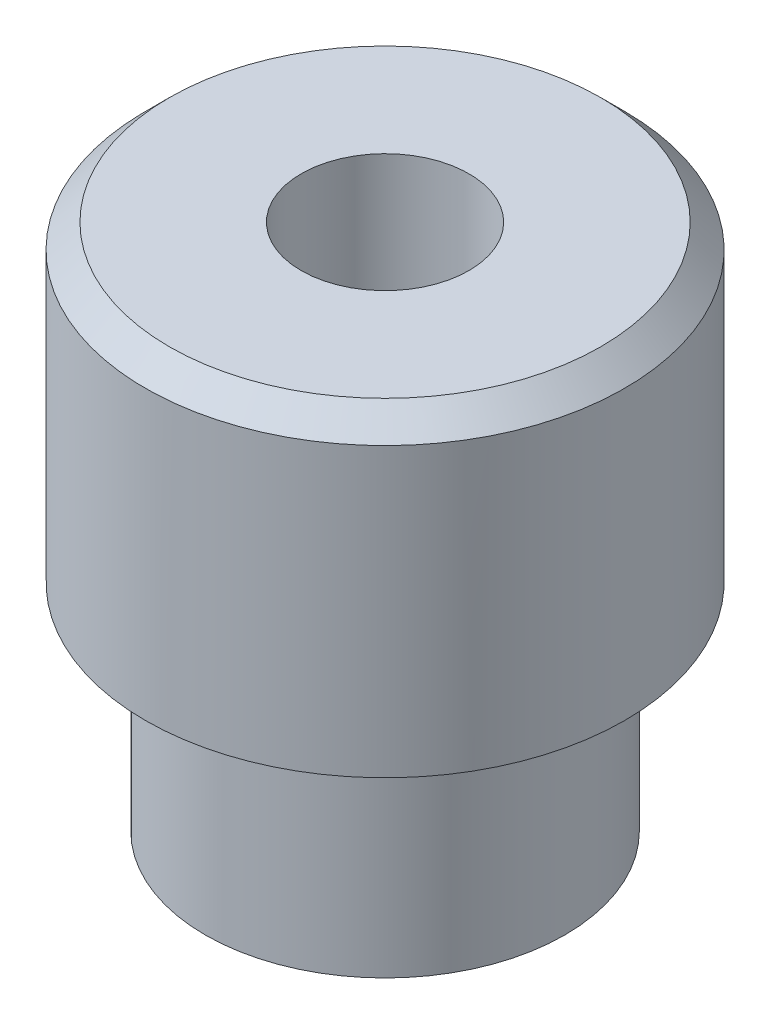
ISO-10303-21;
HEADER;
FILE_DESCRIPTION(('STEP AP214'),'2;1');
FILE_NAME('part.step','',(''),(''),'','','');
FILE_SCHEMA(('AUTOMOTIVE_DESIGN { 1 0 10303 214 1 1 1 1 }'));
ENDSEC;
DATA;
#1=APPLICATION_CONTEXT('core data for automotive mechanical design processes');
#2=APPLICATION_PROTOCOL_DEFINITION('international standard','automotive_design',2000,#1);
#3=PRODUCT_CONTEXT('',#1,'mechanical');
#4=PRODUCT('Part','Part','',(#3));
#5=PRODUCT_RELATED_PRODUCT_CATEGORY('part','',(#4));
#6=PRODUCT_DEFINITION_FORMATION('','',#4);
#7=PRODUCT_DEFINITION_CONTEXT('part definition',#1,'design');
#8=PRODUCT_DEFINITION('design','',#6,#7);
#9=PRODUCT_DEFINITION_SHAPE('','',#8);
#10=(LENGTH_UNIT() NAMED_UNIT(*) SI_UNIT(.MILLI.,.METRE.));
#11=(NAMED_UNIT(*) PLANE_ANGLE_UNIT() SI_UNIT($,.RADIAN.));
#12=(NAMED_UNIT(*) SI_UNIT($,.STERADIAN.) SOLID_ANGLE_UNIT());
#13=UNCERTAINTY_MEASURE_WITH_UNIT(LENGTH_MEASURE(1.E-05),#10,'distance_accuracy_value','');
#14=(GEOMETRIC_REPRESENTATION_CONTEXT(3) GLOBAL_UNCERTAINTY_ASSIGNED_CONTEXT((#13)) GLOBAL_UNIT_ASSIGNED_CONTEXT((#10,
#11,#12)) REPRESENTATION_CONTEXT('',''));
#15=CARTESIAN_POINT('',(0.,0.,0.));
#16=DIRECTION('',(0.,0.,1.));
#17=DIRECTION('',(1.,0.,0.));
#18=AXIS2_PLACEMENT_3D('',#15,#16,#17);
#19=CARTESIAN_POINT('',(0.,9.,0.));
#20=DIRECTION('',(0.,-1.,0.));
#21=DIRECTION('',(0.,0.,-1.));
#22=AXIS2_PLACEMENT_3D('',#19,#20,#21);
#23=CYLINDRICAL_SURFACE('',#22,7.5);
#24=CARTESIAN_POINT('',(0.,7.50000000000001,0.));
#25=DIRECTION('',(0.,1.,0.));
#26=DIRECTION('',(0.,0.,1.));
#27=AXIS2_PLACEMENT_3D('',#24,#25,#26);
#28=CIRCLE('',#27,7.5);
#29=CARTESIAN_POINT('',(0.,7.50000000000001,7.5));
#30=VERTEX_POINT('',#29);
#31=EDGE_CURVE('E44',#30,#30,#28,.F.);
#32=ORIENTED_EDGE('',*,*,#31,.T.);
#33=EDGE_LOOP('',(#32));
#34=FACE_BOUND('',#33,.T.);
#35=CARTESIAN_POINT('',(0.,0.,0.));
#36=DIRECTION('',(0.,1.,0.));
#37=DIRECTION('',(0.,0.,1.));
#38=AXIS2_PLACEMENT_3D('',#35,#36,#37);
#39=CIRCLE('',#38,7.5);
#40=CARTESIAN_POINT('',(0.,0.,7.5));
#41=VERTEX_POINT('',#40);
#42=EDGE_CURVE('E48',#41,#41,#39,.T.);
#43=ORIENTED_EDGE('',*,*,#42,.T.);
#44=EDGE_LOOP('',(#43));
#45=FACE_BOUND('',#44,.T.);
#46=ADVANCED_FACE('F33',(#34,#45),#23,.T.);
#47=CARTESIAN_POINT('',(0.,0.,0.));
#48=DIRECTION('',(0.,1.,0.));
#49=DIRECTION('',(0.,0.,1.));
#50=AXIS2_PLACEMENT_3D('',#47,#48,#49);
#51=PLANE('',#50);
#52=CARTESIAN_POINT('',(0.,0.,0.));
#53=DIRECTION('',(0.,1.,0.));
#54=DIRECTION('',(0.,0.,1.));
#55=AXIS2_PLACEMENT_3D('',#52,#53,#54);
#56=CIRCLE('',#55,3.5);
#57=CARTESIAN_POINT('',(0.,0.,3.5));
#58=VERTEX_POINT('',#57);
#59=EDGE_CURVE('E56',#58,#58,#56,.T.);
#60=ORIENTED_EDGE('',*,*,#59,.T.);
#61=EDGE_LOOP('',(#60));
#62=FACE_BOUND('',#61,.T.);
#63=ORIENTED_EDGE('',*,*,#42,.F.);
#64=EDGE_LOOP('',(#63));
#65=FACE_BOUND('',#64,.T.);
#66=ADVANCED_FACE('F63',(#62,#65),#51,.F.);
#67=CARTESIAN_POINT('',(0.,22.,0.));
#68=DIRECTION('',(0.,-1.,0.));
#69=DIRECTION('',(0.,0.,-1.));
#70=AXIS2_PLACEMENT_3D('',#67,#68,#69);
#71=CYLINDRICAL_SURFACE('',#70,10.);
#72=CARTESIAN_POINT('',(0.,21.,0.));
#73=DIRECTION('',(0.,1.,0.));
#74=DIRECTION('',(0.,0.,1.));
#75=AXIS2_PLACEMENT_3D('',#72,#73,#74);
#76=CIRCLE('',#75,10.);
#77=CARTESIAN_POINT('',(0.,21.,-10.));
#78=VERTEX_POINT('',#77);
#79=EDGE_CURVE('E10',#78,#78,#76,.F.);
#80=CARTESIAN_POINT('',(0.,9.,0.));
#81=DIRECTION('',(0.,1.,0.));
#82=DIRECTION('',(0.,0.,1.));
#83=AXIS2_PLACEMENT_3D('',#80,#81,#82);
#84=CIRCLE('',#83,10.);
#85=CARTESIAN_POINT('',(0.,9.,-10.));
#86=VERTEX_POINT('',#85);
#87=EDGE_CURVE('E53',#86,#86,#84,.T.);
#88=CARTESIAN_POINT('',(0.,21.,-10.));
#89=CARTESIAN_POINT('',(0.,20.875,-10.));
#90=CARTESIAN_POINT('',(0.,20.75,-10.));
#91=CARTESIAN_POINT('',(0.,20.5,-10.));
#92=CARTESIAN_POINT('',(0.,20.375,-10.));
#93=CARTESIAN_POINT('',(0.,20.125,-10.));
#94=CARTESIAN_POINT('',(0.,20.,-10.));
#95=CARTESIAN_POINT('',(0.,19.75,-10.));
#96=CARTESIAN_POINT('',(0.,19.625,-10.));
#97=CARTESIAN_POINT('',(0.,19.375,-10.));
#98=CARTESIAN_POINT('',(0.,19.25,-10.));
#99=CARTESIAN_POINT('',(0.,19.,-10.));
#100=CARTESIAN_POINT('',(0.,18.875,-10.));
#101=CARTESIAN_POINT('',(0.,18.625,-10.));
#102=CARTESIAN_POINT('',(0.,18.5,-10.));
#103=CARTESIAN_POINT('',(0.,18.25,-10.));
#104=CARTESIAN_POINT('',(0.,18.125,-10.));
#105=CARTESIAN_POINT('',(0.,17.875,-10.));
#106=CARTESIAN_POINT('',(0.,17.75,-10.));
#107=CARTESIAN_POINT('',(0.,17.5,-10.));
#108=CARTESIAN_POINT('',(0.,17.375,-10.));
#109=CARTESIAN_POINT('',(0.,17.125,-10.));
#110=CARTESIAN_POINT('',(0.,17.,-10.));
#111=CARTESIAN_POINT('',(0.,16.75,-10.));
#112=CARTESIAN_POINT('',(0.,16.625,-10.));
#113=CARTESIAN_POINT('',(0.,16.375,-10.));
#114=CARTESIAN_POINT('',(0.,16.25,-10.));
#115=CARTESIAN_POINT('',(0.,16.,-10.));
#116=CARTESIAN_POINT('',(0.,15.875,-10.));
#117=CARTESIAN_POINT('',(0.,15.625,-10.));
#118=CARTESIAN_POINT('',(0.,15.5,-10.));
#119=CARTESIAN_POINT('',(0.,15.25,-10.));
#120=CARTESIAN_POINT('',(0.,15.125,-10.));
#121=CARTESIAN_POINT('',(0.,14.875,-10.));
#122=CARTESIAN_POINT('',(0.,14.75,-10.));
#123=CARTESIAN_POINT('',(0.,14.5,-10.));
#124=CARTESIAN_POINT('',(0.,14.375,-10.));
#125=CARTESIAN_POINT('',(0.,14.125,-10.));
#126=CARTESIAN_POINT('',(0.,14.,-10.));
#127=CARTESIAN_POINT('',(0.,13.75,-10.));
#128=CARTESIAN_POINT('',(0.,13.625,-10.));
#129=CARTESIAN_POINT('',(0.,13.375,-10.));
#130=CARTESIAN_POINT('',(0.,13.25,-10.));
#131=CARTESIAN_POINT('',(0.,13.,-10.));
#132=CARTESIAN_POINT('',(0.,12.875,-10.));
#133=CARTESIAN_POINT('',(0.,12.625,-10.));
#134=CARTESIAN_POINT('',(0.,12.5,-10.));
#135=CARTESIAN_POINT('',(0.,12.25,-10.));
#136=CARTESIAN_POINT('',(0.,12.125,-10.));
#137=CARTESIAN_POINT('',(0.,11.875,-10.));
#138=CARTESIAN_POINT('',(0.,11.75,-10.));
#139=CARTESIAN_POINT('',(0.,11.5,-10.));
#140=CARTESIAN_POINT('',(0.,11.375,-10.));
#141=CARTESIAN_POINT('',(0.,11.125,-10.));
#142=CARTESIAN_POINT('',(0.,11.,-10.));
#143=CARTESIAN_POINT('',(0.,10.75,-10.));
#144=CARTESIAN_POINT('',(0.,10.625,-10.));
#145=CARTESIAN_POINT('',(0.,10.375,-10.));
#146=CARTESIAN_POINT('',(0.,10.25,-10.));
#147=CARTESIAN_POINT('',(0.,10.,-10.));
#148=CARTESIAN_POINT('',(0.,9.875,-10.));
#149=CARTESIAN_POINT('',(0.,9.625,-10.));
#150=CARTESIAN_POINT('',(0.,9.5,-10.));
#151=CARTESIAN_POINT('',(0.,9.25,-10.));
#152=CARTESIAN_POINT('',(0.,9.125,-10.));
#153=CARTESIAN_POINT('',(0.,9.,-10.));
#154=B_SPLINE_CURVE_WITH_KNOTS('',3,(#88,#89,#90,#91,#92,#93,#94,#95,#96,#97,#98,#99,#100,#101,
#102,#103,#104,#105,#106,#107,#108,#109,#110,#111,#112,#113,#114,#115,#116,#117,#118,#119,#120,
#121,#122,#123,#124,#125,#126,#127,#128,#129,#130,#131,#132,#133,#134,#135,#136,#137,#138,#139,
#140,#141,#142,#143,#144,#145,#146,#147,#148,#149,#150,#151,#152,#153),.UNSPECIFIED.,.F.,.F.,(4,
2,2,2,2,2,2,2,2,2,2,2,2,2,2,2,2,2,2,2,2,2,2,2,2,2,2,2,2,2,2,2,4),(0.,0.375,0.750000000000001,
1.125,1.5,1.875,2.25,2.625,3.,3.375,3.75,4.125,4.5,4.875,5.25,5.62500000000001,6.00000000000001,
6.37500000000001,6.75000000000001,7.125,7.50000000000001,7.87500000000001,8.25000000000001,
8.62500000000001,9.00000000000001,9.37500000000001,9.75000000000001,10.125,10.5,10.875,11.25,
11.625,12.),.UNSPECIFIED.);
#155=EDGE_CURVE('BSEAM75',#78,#86,#154,.T.);
#156=ORIENTED_EDGE('',*,*,#79,.T.);
#157=ORIENTED_EDGE('',*,*,#87,.T.);
#158=ORIENTED_EDGE('',*,*,#155,.T.);
#159=ORIENTED_EDGE('',*,*,#155,.F.);
#160=EDGE_LOOP('',(#156,#158,#157,#159));
#161=FACE_BOUND('',#160,.T.);
#162=ADVANCED_FACE('F75',(#161),#71,.T.);
#163=CARTESIAN_POINT('',(0.,22.,0.));
#164=DIRECTION('',(0.,1.,0.));
#165=DIRECTION('',(0.,0.,1.));
#166=AXIS2_PLACEMENT_3D('',#163,#164,#165);
#167=PLANE('',#166);
#168=CARTESIAN_POINT('',(0.,22.,0.));
#169=DIRECTION('',(0.,1.,0.));
#170=DIRECTION('',(0.,0.,1.));
#171=AXIS2_PLACEMENT_3D('',#168,#169,#170);
#172=CIRCLE('',#171,3.5);
#173=CARTESIAN_POINT('',(0.,22.,3.5));
#174=VERTEX_POINT('',#173);
#175=EDGE_CURVE('E57',#174,#174,#172,.T.);
#176=ORIENTED_EDGE('',*,*,#175,.F.);
#177=EDGE_LOOP('',(#176));
#178=FACE_BOUND('',#177,.T.);
#179=CARTESIAN_POINT('',(0.,22.,0.));
#180=DIRECTION('',(0.,1.,0.));
#181=DIRECTION('',(0.,0.,1.));
#182=AXIS2_PLACEMENT_3D('',#179,#180,#181);
#183=CIRCLE('',#182,9.00000000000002);
#184=CARTESIAN_POINT('',(0.,22.,9.00000000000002));
#185=VERTEX_POINT('',#184);
#186=EDGE_CURVE('E40',#185,#185,#183,.T.);
#187=ORIENTED_EDGE('',*,*,#186,.T.);
#188=EDGE_LOOP('',(#187));
#189=FACE_BOUND('',#188,.T.);
#190=ADVANCED_FACE('F72',(#178,#189),#167,.T.);
#191=CARTESIAN_POINT('',(0.,9.,0.));
#192=DIRECTION('',(0.,1.,0.));
#193=DIRECTION('',(0.,0.,1.));
#194=AXIS2_PLACEMENT_3D('',#191,#192,#193);
#195=CONICAL_SURFACE('',#194,9.99999999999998,1.03037682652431);
#196=ORIENTED_EDGE('',*,*,#31,.F.);
#197=EDGE_LOOP('',(#196));
#198=FACE_BOUND('',#197,.T.);
#199=ORIENTED_EDGE('',*,*,#87,.F.);
#200=EDGE_LOOP('',(#199));
#201=FACE_BOUND('',#200,.T.);
#202=ADVANCED_FACE('F74',(#198,#201),#195,.T.);
#203=CARTESIAN_POINT('',(0.,22.,0.));
#204=DIRECTION('',(0.,-1.,0.));
#205=DIRECTION('',(0.,0.,-1.));
#206=AXIS2_PLACEMENT_3D('',#203,#204,#205);
#207=CONICAL_SURFACE('',#206,9.00000000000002,0.785398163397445);
#208=ORIENTED_EDGE('',*,*,#79,.F.);
#209=EDGE_LOOP('',(#208));
#210=FACE_BOUND('',#209,.T.);
#211=ORIENTED_EDGE('',*,*,#186,.F.);
#212=EDGE_LOOP('',(#211));
#213=FACE_BOUND('',#212,.T.);
#214=ADVANCED_FACE('F35',(#210,#213),#207,.T.);
#215=CARTESIAN_POINT('',(0.,0.,0.));
#216=DIRECTION('',(0.,1.,0.));
#217=DIRECTION('',(0.,0.,1.));
#218=AXIS2_PLACEMENT_3D('',#215,#216,#217);
#219=CYLINDRICAL_SURFACE('',#218,3.5);
#220=ORIENTED_EDGE('',*,*,#59,.F.);
#221=EDGE_LOOP('',(#220));
#222=FACE_BOUND('',#221,.T.);
#223=ORIENTED_EDGE('',*,*,#175,.T.);
#224=EDGE_LOOP('',(#223));
#225=FACE_BOUND('',#224,.T.);
#226=ADVANCED_FACE('F66',(#222,#225),#219,.F.);
#227=CLOSED_SHELL('',(#46,#66,#162,#190,#202,#214,#226));
#228=MANIFOLD_SOLID_BREP('B2',#227);
#229=ADVANCED_BREP_SHAPE_REPRESENTATION('',(#18,#228),#14);
#230=SHAPE_DEFINITION_REPRESENTATION(#9,#229);
ENDSEC;
END-ISO-10303-21;
